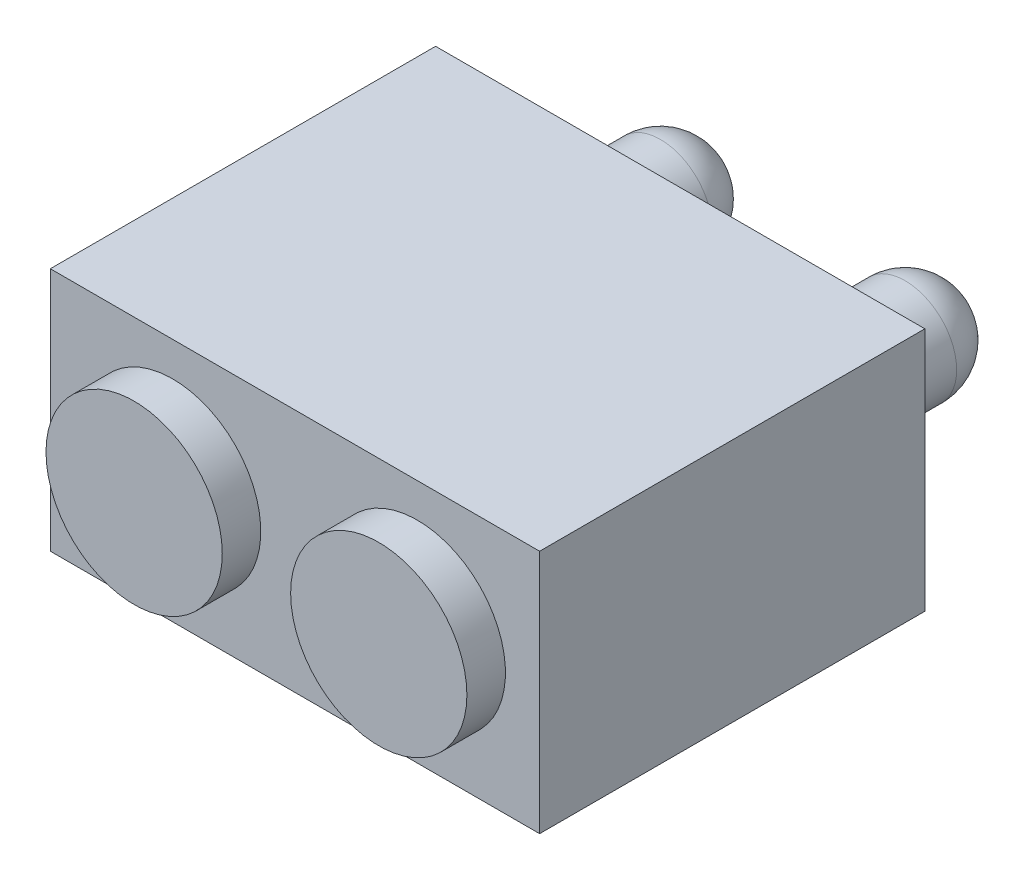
from build123d import *

# Parameters (mm, degrees)
ESQUISSE1_W       = 5.08
ESQUISSE1_H       = 2.54
EXTRUSION1_DEPTH  = 4
ESQUISSE2_R       = 0.915
EXTRUSION2_DEPTH  = 0.4
ESQUISSE3_R       = 0.535
EXTRUSION3_DEPTH  = 1.065
D_ME1_FACE_RADIUS = 0.535
D_ME1_HEIGHT      = 0.535
D_ME2_FACE_RADIUS = 0.535
D_ME2_HEIGHT      = 0.535


with BuildPart() as part:
    # Esquisse1 → Extrusion1 (new body)
    with BuildSketch(Plane.XY):
        with Locations((2.54, 1.27)):
            Rectangle(ESQUISSE1_W, ESQUISSE1_H)
    extrude(amount=EXTRUSION1_DEPTH)

    # Esquisse2 → Extrusion2 (add)
    with BuildSketch(Plane.XY.offset(4)):
        with Locations(Location((3.81, 1.27, 0), (0, 0, 180))):
            Circle(ESQUISSE2_R)
        with Locations(Location((1.27, 1.27, 0), (0, 0, 180))):
            Circle(ESQUISSE2_R)
    extrude(amount=EXTRUSION2_DEPTH)

    # Esquisse3 → Extrusion3 (add)
    with BuildSketch(Plane(origin=(0, 0, 0), x_dir=(-1, 0, 0), z_dir=(0, 0, -1))):
        with Locations((-3.81, 1.27)):
            Circle(ESQUISSE3_R)
        with Locations((-1.27, 1.27)):
            Circle(ESQUISSE3_R)
    extrude(amount=EXTRUSION3_DEPTH)

    # D_me1: a dome of height H over a round flat face of radius A is a cap of a sphere of radius (A * A + H * H) / (2 * H)
    d_me1_r = (D_ME1_FACE_RADIUS * D_ME1_FACE_RADIUS + D_ME1_HEIGHT * D_ME1_HEIGHT) / (2 * D_ME1_HEIGHT)
    d_me1_base = Plane((3.81, 1.27, -1.065), z_dir=(0, 0, -1))
    with Locations(d_me1_base.offset(D_ME1_HEIGHT - d_me1_r)):
        d_me1_ball = Sphere(d_me1_r, mode=Mode.PRIVATE)
    add(split(d_me1_ball, bisect_by=d_me1_base, keep=Keep.TOP, mode=Mode.PRIVATE))

    # D_me2: a dome of height H over a round flat face of radius A is a cap of a sphere of radius (A * A + H * H) / (2 * H)
    d_me2_r = (D_ME2_FACE_RADIUS * D_ME2_FACE_RADIUS + D_ME2_HEIGHT * D_ME2_HEIGHT) / (2 * D_ME2_HEIGHT)
    d_me2_base = Plane((1.27, 1.27, -1.065), z_dir=(0, 0, -1))
    with Locations(d_me2_base.offset(D_ME2_HEIGHT - d_me2_r)):
        d_me2_ball = Sphere(d_me2_r, mode=Mode.PRIVATE)
    add(split(d_me2_ball, bisect_by=d_me2_base, keep=Keep.TOP, mode=Mode.PRIVATE))


solid = part.part
